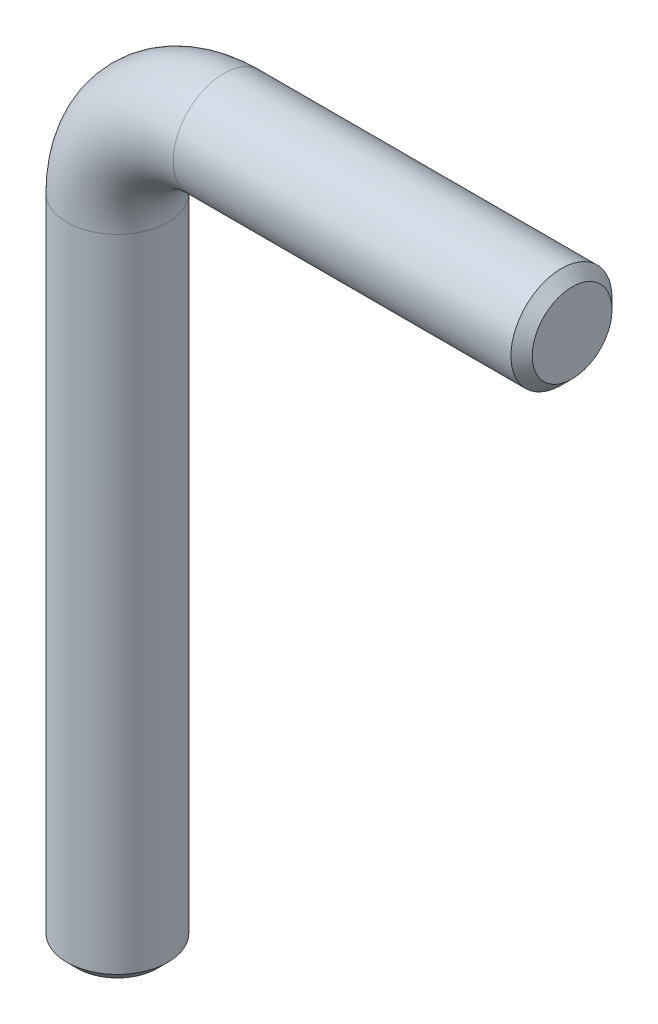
from build123d import *

# Parameters (mm, degrees)
ESBO_O2_R     = 4.75
CHANFRO1_SIZE = 1


with BuildPart() as part:
    # Varredura1: sweep along a path in Esbo_o1
    with BuildLine(Plane.XY) as varredura1_path:
        Line((0, 0), (0, 61.25))
        ThreePointArc((0, 61.25), (2.928932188, 68.321067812), (10, 71.25))
        Line((10, 71.25), (42.75, 71.25))
    # Esbo_o2 → Varredura1 (sweep)
    with BuildSketch(Plane(origin=(0, 0, 0), x_dir=(1, 0, 0), z_dir=(0, 1, 0))):
        Circle(ESBO_O2_R)
    sweep(path=varredura1_path.line)

    # Chanfro1
    chanfro1_edges = [part.edges().sort_by_distance(p)[0] for p in [
        (-4.75, 0, 0),
        (42.75, 76, 0),
    ]]
    chamfer(chanfro1_edges, length=CHANFRO1_SIZE)


solid = part.part
